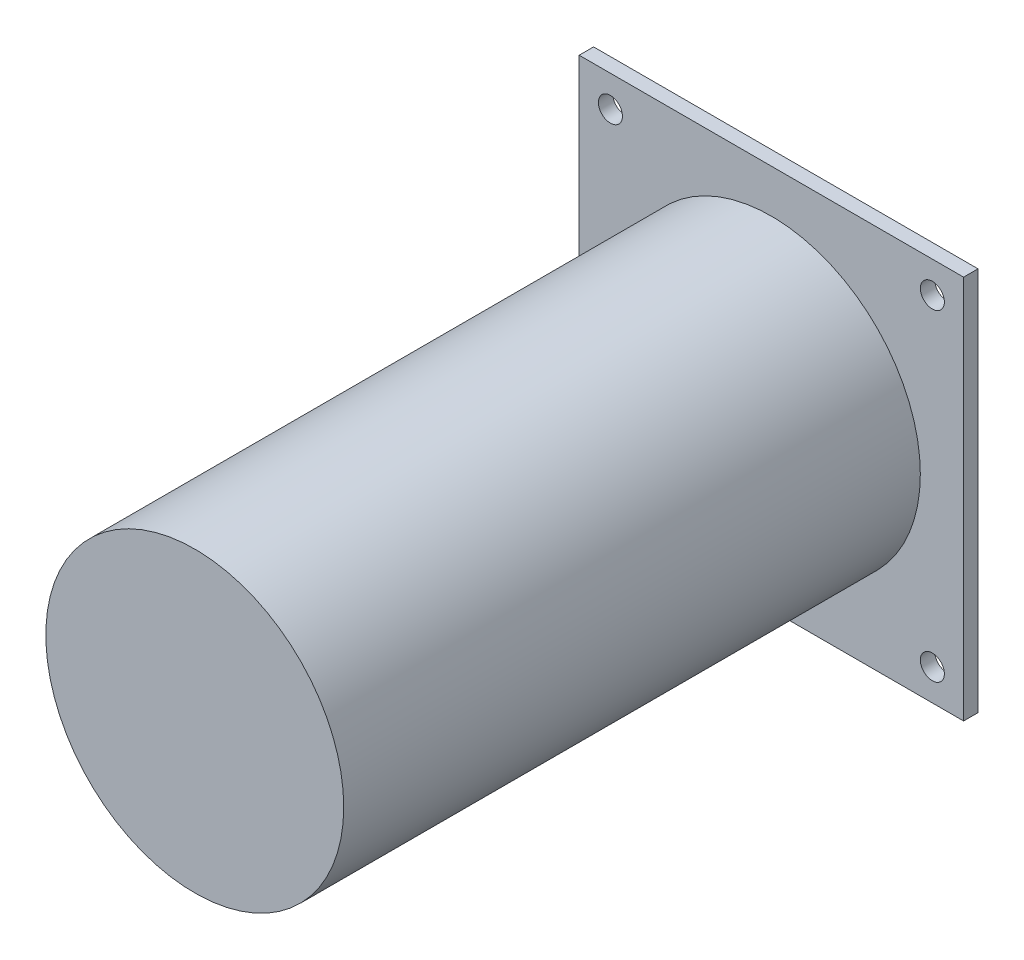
ISO-10303-21;
HEADER;
FILE_DESCRIPTION(('STEP AP214'),'2;1');
FILE_NAME('part.step','',(''),(''),'','','');
FILE_SCHEMA(('AUTOMOTIVE_DESIGN { 1 0 10303 214 1 1 1 1 }'));
ENDSEC;
DATA;
#1=APPLICATION_CONTEXT('core data for automotive mechanical design processes');
#2=APPLICATION_PROTOCOL_DEFINITION('international standard','automotive_design',2000,#1);
#3=PRODUCT_CONTEXT('',#1,'mechanical');
#4=PRODUCT('Part','Part','',(#3));
#5=PRODUCT_RELATED_PRODUCT_CATEGORY('part','',(#4));
#6=PRODUCT_DEFINITION_FORMATION('','',#4);
#7=PRODUCT_DEFINITION_CONTEXT('part definition',#1,'design');
#8=PRODUCT_DEFINITION('design','',#6,#7);
#9=PRODUCT_DEFINITION_SHAPE('','',#8);
#10=(LENGTH_UNIT() NAMED_UNIT(*) SI_UNIT(.MILLI.,.METRE.));
#11=(NAMED_UNIT(*) PLANE_ANGLE_UNIT() SI_UNIT($,.RADIAN.));
#12=(NAMED_UNIT(*) SI_UNIT($,.STERADIAN.) SOLID_ANGLE_UNIT());
#13=UNCERTAINTY_MEASURE_WITH_UNIT(LENGTH_MEASURE(1.E-05),#10,'distance_accuracy_value','');
#14=(GEOMETRIC_REPRESENTATION_CONTEXT(3) GLOBAL_UNCERTAINTY_ASSIGNED_CONTEXT((#13)) GLOBAL_UNIT_ASSIGNED_CONTEXT((#10,
#11,#12)) REPRESENTATION_CONTEXT('',''));
#15=CARTESIAN_POINT('',(0.,0.,0.));
#16=DIRECTION('',(0.,0.,1.));
#17=DIRECTION('',(1.,0.,0.));
#18=AXIS2_PLACEMENT_3D('',#15,#16,#17);
#19=CARTESIAN_POINT('',(0.,0.,-22.));
#20=DIRECTION('',(0.,0.,1.));
#21=DIRECTION('',(1.,0.,0.));
#22=AXIS2_PLACEMENT_3D('',#19,#20,#21);
#23=CYLINDRICAL_SURFACE('',#22,18.);
#24=CARTESIAN_POINT('',(0.,0.,-12.));
#25=DIRECTION('',(0.,0.,-1.));
#26=DIRECTION('',(-1.,0.,0.));
#27=AXIS2_PLACEMENT_3D('',#24,#25,#26);
#28=CIRCLE('',#27,18.);
#29=CARTESIAN_POINT('',(-18.,0.,-12.));
#30=VERTEX_POINT('',#29);
#31=EDGE_CURVE('E137',#30,#30,#28,.T.);
#32=ORIENTED_EDGE('',*,*,#31,.T.);
#33=EDGE_LOOP('',(#32));
#34=FACE_BOUND('',#33,.T.);
#35=CARTESIAN_POINT('',(0.,0.,-14.5));
#36=DIRECTION('',(0.,0.,-1.));
#37=DIRECTION('',(-1.,0.,0.));
#38=AXIS2_PLACEMENT_3D('',#35,#36,#37);
#39=CIRCLE('',#38,18.);
#40=CARTESIAN_POINT('',(-18.,0.,-14.5));
#41=VERTEX_POINT('',#40);
#42=EDGE_CURVE('E130',#41,#41,#39,.T.);
#43=ORIENTED_EDGE('',*,*,#42,.F.);
#44=EDGE_LOOP('',(#43));
#45=FACE_BOUND('',#44,.T.);
#46=ADVANCED_FACE('F41',(#34,#45),#23,.T.);
#47=CARTESIAN_POINT('',(0.,0.,120.));
#48=DIRECTION('',(0.,0.,-1.));
#49=DIRECTION('',(-1.,0.,0.));
#50=AXIS2_PLACEMENT_3D('',#47,#48,#49);
#51=CYLINDRICAL_SURFACE('',#50,31.);
#52=CARTESIAN_POINT('',(0.,0.,120.));
#53=DIRECTION('',(0.,0.,1.));
#54=DIRECTION('',(1.,0.,0.));
#55=AXIS2_PLACEMENT_3D('',#52,#53,#54);
#56=CIRCLE('',#55,31.);
#57=CARTESIAN_POINT('',(31.,0.,120.));
#58=VERTEX_POINT('',#57);
#59=EDGE_CURVE('E121',#58,#58,#56,.T.);
#60=ORIENTED_EDGE('',*,*,#59,.F.);
#61=EDGE_LOOP('',(#60));
#62=FACE_BOUND('',#61,.T.);
#63=CARTESIAN_POINT('',(0.,0.,0.));
#64=DIRECTION('',(0.,0.,1.));
#65=DIRECTION('',(1.,0.,0.));
#66=AXIS2_PLACEMENT_3D('',#63,#64,#65);
#67=CIRCLE('',#66,31.);
#68=CARTESIAN_POINT('',(31.,0.,0.));
#69=VERTEX_POINT('',#68);
#70=EDGE_CURVE('E120',#69,#69,#67,.T.);
#71=ORIENTED_EDGE('',*,*,#70,.T.);
#72=EDGE_LOOP('',(#71));
#73=FACE_BOUND('',#72,.T.);
#74=ADVANCED_FACE('F174',(#62,#73),#51,.T.);
#75=CARTESIAN_POINT('',(0.,0.,120.));
#76=DIRECTION('',(0.,0.,1.));
#77=DIRECTION('',(1.,0.,0.));
#78=AXIS2_PLACEMENT_3D('',#75,#76,#77);
#79=PLANE('',#78);
#80=ORIENTED_EDGE('',*,*,#59,.T.);
#81=EDGE_LOOP('',(#80));
#82=FACE_BOUND('',#81,.T.);
#83=ADVANCED_FACE('F180',(#82),#79,.T.);
#84=CARTESIAN_POINT('',(-40.,-40.,-3.));
#85=DIRECTION('',(1.,0.,0.));
#86=DIRECTION('',(0.,0.,-1.));
#87=AXIS2_PLACEMENT_3D('',#84,#85,#86);
#88=PLANE('',#87);
#89=DIRECTION('',(0.,1.,0.));
#90=VECTOR('',#89,1.);
#91=CARTESIAN_POINT('',(-40.,-40.,0.));
#92=LINE('',#91,#90);
#93=CARTESIAN_POINT('',(-40.,-40.,0.));
#94=VERTEX_POINT('',#93);
#95=CARTESIAN_POINT('',(-40.,40.,0.));
#96=VERTEX_POINT('',#95);
#97=EDGE_CURVE('E110',#94,#96,#92,.T.);
#98=ORIENTED_EDGE('',*,*,#97,.T.);
#99=DIRECTION('',(0.,0.,1.));
#100=VECTOR('',#99,1.);
#101=CARTESIAN_POINT('',(-40.,40.,-3.));
#102=LINE('',#101,#100);
#103=CARTESIAN_POINT('',(-40.,40.,-3.));
#104=VERTEX_POINT('',#103);
#105=EDGE_CURVE('E101',#104,#96,#102,.T.);
#106=ORIENTED_EDGE('',*,*,#105,.F.);
#107=DIRECTION('',(0.,1.,0.));
#108=VECTOR('',#107,1.);
#109=CARTESIAN_POINT('',(-40.,-40.,-3.));
#110=LINE('',#109,#108);
#111=CARTESIAN_POINT('',(-40.,-40.,-3.));
#112=VERTEX_POINT('',#111);
#113=EDGE_CURVE('E95',#112,#104,#110,.T.);
#114=ORIENTED_EDGE('',*,*,#113,.F.);
#115=DIRECTION('',(0.,0.,1.));
#116=VECTOR('',#115,1.);
#117=CARTESIAN_POINT('',(-40.,-40.,-3.));
#118=LINE('',#117,#116);
#119=EDGE_CURVE('E106',#112,#94,#118,.T.);
#120=ORIENTED_EDGE('',*,*,#119,.T.);
#121=EDGE_LOOP('',(#98,#106,#114,#120));
#122=FACE_BOUND('',#121,.T.);
#123=ADVANCED_FACE('F258',(#122),#88,.F.);
#124=CARTESIAN_POINT('',(40.,40.,-3.));
#125=DIRECTION('',(0.,-1.,0.));
#126=DIRECTION('',(0.,0.,-1.));
#127=AXIS2_PLACEMENT_3D('',#124,#125,#126);
#128=PLANE('',#127);
#129=DIRECTION('',(1.,0.,0.));
#130=VECTOR('',#129,1.);
#131=CARTESIAN_POINT('',(40.,40.,0.));
#132=LINE('',#131,#130);
#133=CARTESIAN_POINT('',(40.,40.,0.));
#134=VERTEX_POINT('',#133);
#135=EDGE_CURVE('E100',#96,#134,#132,.T.);
#136=ORIENTED_EDGE('',*,*,#135,.T.);
#137=DIRECTION('',(0.,0.,1.));
#138=VECTOR('',#137,1.);
#139=CARTESIAN_POINT('',(40.,40.,-3.));
#140=LINE('',#139,#138);
#141=CARTESIAN_POINT('',(40.,40.,-3.));
#142=VERTEX_POINT('',#141);
#143=EDGE_CURVE('E98',#142,#134,#140,.T.);
#144=ORIENTED_EDGE('',*,*,#143,.F.);
#145=DIRECTION('',(1.,0.,0.));
#146=VECTOR('',#145,1.);
#147=CARTESIAN_POINT('',(40.,40.,-3.));
#148=LINE('',#147,#146);
#149=EDGE_CURVE('E90',#104,#142,#148,.T.);
#150=ORIENTED_EDGE('',*,*,#149,.F.);
#151=ORIENTED_EDGE('',*,*,#105,.T.);
#152=EDGE_LOOP('',(#136,#144,#150,#151));
#153=FACE_BOUND('',#152,.T.);
#154=ADVANCED_FACE('F99',(#153),#128,.F.);
#155=CARTESIAN_POINT('',(40.,-40.,-3.));
#156=DIRECTION('',(-1.,0.,0.));
#157=DIRECTION('',(0.,0.,1.));
#158=AXIS2_PLACEMENT_3D('',#155,#156,#157);
#159=PLANE('',#158);
#160=DIRECTION('',(0.,-1.,0.));
#161=VECTOR('',#160,1.);
#162=CARTESIAN_POINT('',(40.,-40.,0.));
#163=LINE('',#162,#161);
#164=CARTESIAN_POINT('',(40.,-40.,0.));
#165=VERTEX_POINT('',#164);
#166=EDGE_CURVE('E76',#134,#165,#163,.T.);
#167=ORIENTED_EDGE('',*,*,#166,.T.);
#168=DIRECTION('',(0.,0.,1.));
#169=VECTOR('',#168,1.);
#170=CARTESIAN_POINT('',(40.,-40.,-3.));
#171=LINE('',#170,#169);
#172=CARTESIAN_POINT('',(40.,-40.,-3.));
#173=VERTEX_POINT('',#172);
#174=EDGE_CURVE('E102',#173,#165,#171,.T.);
#175=ORIENTED_EDGE('',*,*,#174,.F.);
#176=DIRECTION('',(0.,-1.,0.));
#177=VECTOR('',#176,1.);
#178=CARTESIAN_POINT('',(40.,-40.,-3.));
#179=LINE('',#178,#177);
#180=EDGE_CURVE('E93',#142,#173,#179,.T.);
#181=ORIENTED_EDGE('',*,*,#180,.F.);
#182=ORIENTED_EDGE('',*,*,#143,.T.);
#183=EDGE_LOOP('',(#167,#175,#181,#182));
#184=FACE_BOUND('',#183,.T.);
#185=ADVANCED_FACE('F104',(#184),#159,.F.);
#186=CARTESIAN_POINT('',(40.,-40.,-3.));
#187=DIRECTION('',(0.,1.,0.));
#188=DIRECTION('',(0.,0.,1.));
#189=AXIS2_PLACEMENT_3D('',#186,#187,#188);
#190=PLANE('',#189);
#191=DIRECTION('',(-1.,0.,0.));
#192=VECTOR('',#191,1.);
#193=CARTESIAN_POINT('',(40.,-40.,0.));
#194=LINE('',#193,#192);
#195=EDGE_CURVE('E82',#165,#94,#194,.T.);
#196=ORIENTED_EDGE('',*,*,#195,.T.);
#197=ORIENTED_EDGE('',*,*,#119,.F.);
#198=DIRECTION('',(-1.,0.,0.));
#199=VECTOR('',#198,1.);
#200=CARTESIAN_POINT('',(40.,-40.,-3.));
#201=LINE('',#200,#199);
#202=EDGE_CURVE('E59',#173,#112,#201,.T.);
#203=ORIENTED_EDGE('',*,*,#202,.F.);
#204=ORIENTED_EDGE('',*,*,#174,.T.);
#205=EDGE_LOOP('',(#196,#197,#203,#204));
#206=FACE_BOUND('',#205,.T.);
#207=ADVANCED_FACE('F229',(#206),#190,.F.);
#208=CARTESIAN_POINT('',(0.,0.,-3.));
#209=DIRECTION('',(0.,0.,1.));
#210=DIRECTION('',(1.,0.,0.));
#211=AXIS2_PLACEMENT_3D('',#208,#209,#210);
#212=PLANE('',#211);
#213=CARTESIAN_POINT('',(33.5,33.5,-3.));
#214=DIRECTION('',(0.,0.,-1.));
#215=DIRECTION('',(-1.,0.,0.));
#216=AXIS2_PLACEMENT_3D('',#213,#214,#215);
#217=CIRCLE('',#216,2.49999999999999);
#218=CARTESIAN_POINT('',(31.,33.5,-3.));
#219=VERTEX_POINT('',#218);
#220=EDGE_CURVE('E220',#219,#219,#217,.T.);
#221=ORIENTED_EDGE('',*,*,#220,.F.);
#222=EDGE_LOOP('',(#221));
#223=FACE_BOUND('',#222,.T.);
#224=CARTESIAN_POINT('',(33.5,-33.5,-3.));
#225=DIRECTION('',(0.,0.,-1.));
#226=DIRECTION('',(-1.,0.,0.));
#227=AXIS2_PLACEMENT_3D('',#224,#225,#226);
#228=CIRCLE('',#227,2.49999999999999);
#229=CARTESIAN_POINT('',(31.,-33.5,-3.));
#230=VERTEX_POINT('',#229);
#231=EDGE_CURVE('E214',#230,#230,#228,.T.);
#232=ORIENTED_EDGE('',*,*,#231,.F.);
#233=EDGE_LOOP('',(#232));
#234=FACE_BOUND('',#233,.T.);
#235=CARTESIAN_POINT('',(-33.5,-33.5,-3.));
#236=DIRECTION('',(0.,0.,-1.));
#237=DIRECTION('',(-1.,0.,0.));
#238=AXIS2_PLACEMENT_3D('',#235,#236,#237);
#239=CIRCLE('',#238,2.49999999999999);
#240=CARTESIAN_POINT('',(-36.,-33.5,-3.));
#241=VERTEX_POINT('',#240);
#242=EDGE_CURVE('E211',#241,#241,#239,.T.);
#243=ORIENTED_EDGE('',*,*,#242,.F.);
#244=EDGE_LOOP('',(#243));
#245=FACE_BOUND('',#244,.T.);
#246=CARTESIAN_POINT('',(-33.5,33.5,-3.));
#247=DIRECTION('',(0.,0.,-1.));
#248=DIRECTION('',(-1.,0.,0.));
#249=AXIS2_PLACEMENT_3D('',#246,#247,#248);
#250=CIRCLE('',#249,2.49999999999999);
#251=CARTESIAN_POINT('',(-36.,33.5,-3.));
#252=VERTEX_POINT('',#251);
#253=EDGE_CURVE('E205',#252,#252,#250,.T.);
#254=ORIENTED_EDGE('',*,*,#253,.F.);
#255=EDGE_LOOP('',(#254));
#256=FACE_BOUND('',#255,.T.);
#257=CARTESIAN_POINT('',(0.,0.,-3.));
#258=DIRECTION('',(0.,0.,1.));
#259=DIRECTION('',(1.,0.,0.));
#260=AXIS2_PLACEMENT_3D('',#257,#258,#259);
#261=CIRCLE('',#260,6.);
#262=CARTESIAN_POINT('',(6.,0.,-3.));
#263=VERTEX_POINT('',#262);
#264=EDGE_CURVE('E124',#263,#263,#261,.F.);
#265=ORIENTED_EDGE('',*,*,#264,.F.);
#266=EDGE_LOOP('',(#265));
#267=FACE_BOUND('',#266,.T.);
#268=ORIENTED_EDGE('',*,*,#113,.T.);
#269=ORIENTED_EDGE('',*,*,#149,.T.);
#270=ORIENTED_EDGE('',*,*,#180,.T.);
#271=ORIENTED_EDGE('',*,*,#202,.T.);
#272=EDGE_LOOP('',(#268,#269,#270,#271));
#273=FACE_BOUND('',#272,.T.);
#274=ADVANCED_FACE('F91',(#223,#234,#245,#256,#267,#273),#212,.F.);
#275=CARTESIAN_POINT('',(0.,0.,0.));
#276=DIRECTION('',(0.,0.,1.));
#277=DIRECTION('',(1.,0.,0.));
#278=AXIS2_PLACEMENT_3D('',#275,#276,#277);
#279=PLANE('',#278);
#280=CARTESIAN_POINT('',(33.5,33.5,0.));
#281=DIRECTION('',(0.,0.,1.));
#282=DIRECTION('',(1.,0.,0.));
#283=AXIS2_PLACEMENT_3D('',#280,#281,#282);
#284=CIRCLE('',#283,2.49999999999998);
#285=CARTESIAN_POINT('',(36.,33.5,0.));
#286=VERTEX_POINT('',#285);
#287=EDGE_CURVE('E217',#286,#286,#284,.T.);
#288=ORIENTED_EDGE('',*,*,#287,.F.);
#289=EDGE_LOOP('',(#288));
#290=FACE_BOUND('',#289,.T.);
#291=CARTESIAN_POINT('',(33.5,-33.5,0.));
#292=DIRECTION('',(0.,0.,1.));
#293=DIRECTION('',(1.,0.,0.));
#294=AXIS2_PLACEMENT_3D('',#291,#292,#293);
#295=CIRCLE('',#294,2.49999999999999);
#296=CARTESIAN_POINT('',(36.,-33.5,0.));
#297=VERTEX_POINT('',#296);
#298=EDGE_CURVE('E45',#297,#297,#295,.T.);
#299=ORIENTED_EDGE('',*,*,#298,.F.);
#300=EDGE_LOOP('',(#299));
#301=FACE_BOUND('',#300,.T.);
#302=CARTESIAN_POINT('',(-33.5,-33.5,0.));
#303=DIRECTION('',(0.,0.,1.));
#304=DIRECTION('',(1.,0.,0.));
#305=AXIS2_PLACEMENT_3D('',#302,#303,#304);
#306=CIRCLE('',#305,2.49999999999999);
#307=CARTESIAN_POINT('',(-31.,-33.5,0.));
#308=VERTEX_POINT('',#307);
#309=EDGE_CURVE('E208',#308,#308,#306,.T.);
#310=ORIENTED_EDGE('',*,*,#309,.F.);
#311=EDGE_LOOP('',(#310));
#312=FACE_BOUND('',#311,.T.);
#313=CARTESIAN_POINT('',(-33.5,33.5,0.));
#314=DIRECTION('',(0.,0.,1.));
#315=DIRECTION('',(1.,0.,0.));
#316=AXIS2_PLACEMENT_3D('',#313,#314,#315);
#317=CIRCLE('',#316,2.49999999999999);
#318=CARTESIAN_POINT('',(-31.,33.5,0.));
#319=VERTEX_POINT('',#318);
#320=EDGE_CURVE('E134',#319,#319,#317,.T.);
#321=ORIENTED_EDGE('',*,*,#320,.F.);
#322=EDGE_LOOP('',(#321));
#323=FACE_BOUND('',#322,.T.);
#324=ORIENTED_EDGE('',*,*,#70,.F.);
#325=EDGE_LOOP('',(#324));
#326=FACE_BOUND('',#325,.T.);
#327=ORIENTED_EDGE('',*,*,#97,.F.);
#328=ORIENTED_EDGE('',*,*,#195,.F.);
#329=ORIENTED_EDGE('',*,*,#166,.F.);
#330=ORIENTED_EDGE('',*,*,#135,.F.);
#331=EDGE_LOOP('',(#327,#328,#329,#330));
#332=FACE_BOUND('',#331,.T.);
#333=ADVANCED_FACE('F228',(#290,#301,#312,#323,#326,#332),#279,.T.);
#334=CARTESIAN_POINT('',(0.,0.,-12.));
#335=DIRECTION('',(0.,0.,1.));
#336=DIRECTION('',(1.,0.,0.));
#337=AXIS2_PLACEMENT_3D('',#334,#335,#336);
#338=CYLINDRICAL_SURFACE('',#337,6.);
#339=CARTESIAN_POINT('',(0.,0.,-12.));
#340=DIRECTION('',(0.,0.,-1.));
#341=DIRECTION('',(-1.,0.,0.));
#342=AXIS2_PLACEMENT_3D('',#339,#340,#341);
#343=CIRCLE('',#342,6.);
#344=CARTESIAN_POINT('',(-6.,0.,-12.));
#345=VERTEX_POINT('',#344);
#346=EDGE_CURVE('E113',#345,#345,#343,.T.);
#347=ORIENTED_EDGE('',*,*,#346,.F.);
#348=EDGE_LOOP('',(#347));
#349=FACE_BOUND('',#348,.T.);
#350=ORIENTED_EDGE('',*,*,#264,.T.);
#351=EDGE_LOOP('',(#350));
#352=FACE_BOUND('',#351,.T.);
#353=ADVANCED_FACE('F239',(#349,#352),#338,.T.);
#354=CARTESIAN_POINT('',(0.,0.,-12.));
#355=DIRECTION('',(0.,0.,-1.));
#356=DIRECTION('',(-1.,0.,0.));
#357=AXIS2_PLACEMENT_3D('',#354,#355,#356);
#358=PLANE('',#357);
#359=ORIENTED_EDGE('',*,*,#346,.T.);
#360=EDGE_LOOP('',(#359));
#361=FACE_BOUND('',#360,.T.);
#362=ORIENTED_EDGE('',*,*,#31,.F.);
#363=EDGE_LOOP('',(#362));
#364=FACE_BOUND('',#363,.T.);
#365=ADVANCED_FACE('F241',(#361,#364),#358,.F.);
#366=CARTESIAN_POINT('',(0.,22.,-19.5));
#367=DIRECTION('',(0.,0.,-1.));
#368=DIRECTION('',(-1.,0.,0.));
#369=AXIS2_PLACEMENT_3D('',#366,#367,#368);
#370=PLANE('',#369);
#371=CARTESIAN_POINT('',(0.,0.,-19.5));
#372=DIRECTION('',(0.,0.,-1.));
#373=DIRECTION('',(-1.,0.,0.));
#374=AXIS2_PLACEMENT_3D('',#371,#372,#373);
#375=CIRCLE('',#374,15.5);
#376=CARTESIAN_POINT('',(-15.5,0.,-19.5));
#377=VERTEX_POINT('',#376);
#378=EDGE_CURVE('E51',#377,#377,#375,.T.);
#379=ORIENTED_EDGE('',*,*,#378,.T.);
#380=EDGE_LOOP('',(#379));
#381=FACE_BOUND('',#380,.T.);
#382=CARTESIAN_POINT('',(0.,0.,-19.5));
#383=DIRECTION('',(0.,0.,-1.));
#384=DIRECTION('',(-1.,0.,0.));
#385=AXIS2_PLACEMENT_3D('',#382,#383,#384);
#386=CIRCLE('',#385,18.);
#387=CARTESIAN_POINT('',(-18.,0.,-19.5));
#388=VERTEX_POINT('',#387);
#389=EDGE_CURVE('E133',#388,#388,#386,.T.);
#390=ORIENTED_EDGE('',*,*,#389,.F.);
#391=EDGE_LOOP('',(#390));
#392=FACE_BOUND('',#391,.T.);
#393=ADVANCED_FACE('F146',(#381,#392),#370,.F.);
#394=CARTESIAN_POINT('',(0.,22.,-14.5));
#395=DIRECTION('',(0.,0.,-1.));
#396=DIRECTION('',(-1.,0.,0.));
#397=AXIS2_PLACEMENT_3D('',#394,#395,#396);
#398=PLANE('',#397);
#399=CARTESIAN_POINT('',(0.,0.,-14.5));
#400=DIRECTION('',(0.,0.,-1.));
#401=DIRECTION('',(-1.,0.,0.));
#402=AXIS2_PLACEMENT_3D('',#399,#400,#401);
#403=CIRCLE('',#402,15.5);
#404=CARTESIAN_POINT('',(-15.5,0.,-14.5));
#405=VERTEX_POINT('',#404);
#406=EDGE_CURVE('E11',#405,#405,#403,.F.);
#407=ORIENTED_EDGE('',*,*,#406,.T.);
#408=EDGE_LOOP('',(#407));
#409=FACE_BOUND('',#408,.T.);
#410=ORIENTED_EDGE('',*,*,#42,.T.);
#411=EDGE_LOOP('',(#410));
#412=FACE_BOUND('',#411,.T.);
#413=ADVANCED_FACE('F159',(#409,#412),#398,.T.);
#414=CARTESIAN_POINT('',(0.,0.,0.));
#415=DIRECTION('',(0.,0.,1.));
#416=DIRECTION('',(1.,0.,0.));
#417=AXIS2_PLACEMENT_3D('',#414,#415,#416);
#418=CYLINDRICAL_SURFACE('',#417,14.);
#419=CARTESIAN_POINT('',(0.,0.,-18.));
#420=DIRECTION('',(0.,0.,-1.));
#421=DIRECTION('',(-1.,0.,0.));
#422=AXIS2_PLACEMENT_3D('',#419,#420,#421);
#423=CIRCLE('',#422,14.);
#424=CARTESIAN_POINT('',(-14.,0.,-18.));
#425=VERTEX_POINT('',#424);
#426=EDGE_CURVE('E140',#425,#425,#423,.F.);
#427=ORIENTED_EDGE('',*,*,#426,.T.);
#428=EDGE_LOOP('',(#427));
#429=FACE_BOUND('',#428,.T.);
#430=CARTESIAN_POINT('',(0.,0.,-16.));
#431=DIRECTION('',(0.,0.,-1.));
#432=DIRECTION('',(-1.,0.,0.));
#433=AXIS2_PLACEMENT_3D('',#430,#431,#432);
#434=CIRCLE('',#433,14.);
#435=CARTESIAN_POINT('',(-14.,0.,-16.));
#436=VERTEX_POINT('',#435);
#437=EDGE_CURVE('E129',#436,#436,#434,.T.);
#438=ORIENTED_EDGE('',*,*,#437,.T.);
#439=EDGE_LOOP('',(#438));
#440=FACE_BOUND('',#439,.T.);
#441=ADVANCED_FACE('F155',(#429,#440),#418,.T.);
#442=CARTESIAN_POINT('',(0.,0.,-22.));
#443=DIRECTION('',(0.,0.,-1.));
#444=DIRECTION('',(-1.,0.,0.));
#445=AXIS2_PLACEMENT_3D('',#442,#443,#444);
#446=PLANE('',#445);
#447=CARTESIAN_POINT('',(0.,0.,-22.));
#448=DIRECTION('',(0.,0.,-1.));
#449=DIRECTION('',(-1.,0.,0.));
#450=AXIS2_PLACEMENT_3D('',#447,#448,#449);
#451=CIRCLE('',#450,18.);
#452=CARTESIAN_POINT('',(-18.,0.,-22.));
#453=VERTEX_POINT('',#452);
#454=EDGE_CURVE('E197',#453,#453,#451,.T.);
#455=ORIENTED_EDGE('',*,*,#454,.T.);
#456=EDGE_LOOP('',(#455));
#457=FACE_BOUND('',#456,.T.);
#458=ADVANCED_FACE('F158',(#457),#446,.T.);
#459=ORIENTED_EDGE('',*,*,#389,.T.);
#460=EDGE_LOOP('',(#459));
#461=FACE_BOUND('',#460,.T.);
#462=ORIENTED_EDGE('',*,*,#454,.F.);
#463=EDGE_LOOP('',(#462));
#464=FACE_BOUND('',#463,.T.);
#465=ADVANCED_FACE('F152',(#461,#464),#23,.T.);
#466=CARTESIAN_POINT('',(0.,0.,-18.));
#467=DIRECTION('',(0.,0.,-1.));
#468=DIRECTION('',(-1.,0.,0.));
#469=AXIS2_PLACEMENT_3D('',#466,#467,#468);
#470=TOROIDAL_SURFACE('',#469,15.5,1.5);
#471=ORIENTED_EDGE('',*,*,#378,.F.);
#472=EDGE_LOOP('',(#471));
#473=FACE_BOUND('',#472,.T.);
#474=ORIENTED_EDGE('',*,*,#426,.F.);
#475=EDGE_LOOP('',(#474));
#476=FACE_BOUND('',#475,.T.);
#477=ADVANCED_FACE('F149',(#473,#476),#470,.F.);
#478=CARTESIAN_POINT('',(0.,0.,-16.));
#479=DIRECTION('',(0.,0.,-1.));
#480=DIRECTION('',(-1.,0.,0.));
#481=AXIS2_PLACEMENT_3D('',#478,#479,#480);
#482=TOROIDAL_SURFACE('',#481,15.5,1.5);
#483=ORIENTED_EDGE('',*,*,#437,.F.);
#484=EDGE_LOOP('',(#483));
#485=FACE_BOUND('',#484,.T.);
#486=ORIENTED_EDGE('',*,*,#406,.F.);
#487=EDGE_LOOP('',(#486));
#488=FACE_BOUND('',#487,.T.);
#489=ADVANCED_FACE('F43',(#485,#488),#482,.F.);
#490=CARTESIAN_POINT('',(-33.5,33.5,-3.));
#491=DIRECTION('',(0.,0.,-1.));
#492=DIRECTION('',(-1.,0.,0.));
#493=AXIS2_PLACEMENT_3D('',#490,#491,#492);
#494=CYLINDRICAL_SURFACE('',#493,2.49999999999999);
#495=ORIENTED_EDGE('',*,*,#320,.T.);
#496=EDGE_LOOP('',(#495));
#497=FACE_BOUND('',#496,.T.);
#498=ORIENTED_EDGE('',*,*,#253,.T.);
#499=EDGE_LOOP('',(#498));
#500=FACE_BOUND('',#499,.T.);
#501=ADVANCED_FACE('F165',(#497,#500),#494,.F.);
#502=CARTESIAN_POINT('',(-33.5,-33.5,-3.));
#503=DIRECTION('',(0.,0.,-1.));
#504=DIRECTION('',(-1.,0.,0.));
#505=AXIS2_PLACEMENT_3D('',#502,#503,#504);
#506=CYLINDRICAL_SURFACE('',#505,2.49999999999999);
#507=ORIENTED_EDGE('',*,*,#309,.T.);
#508=EDGE_LOOP('',(#507));
#509=FACE_BOUND('',#508,.T.);
#510=ORIENTED_EDGE('',*,*,#242,.T.);
#511=EDGE_LOOP('',(#510));
#512=FACE_BOUND('',#511,.T.);
#513=ADVANCED_FACE('F316',(#509,#512),#506,.F.);
#514=CARTESIAN_POINT('',(33.5,-33.5,-3.));
#515=DIRECTION('',(0.,0.,-1.));
#516=DIRECTION('',(-1.,0.,0.));
#517=AXIS2_PLACEMENT_3D('',#514,#515,#516);
#518=CYLINDRICAL_SURFACE('',#517,2.49999999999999);
#519=ORIENTED_EDGE('',*,*,#298,.T.);
#520=EDGE_LOOP('',(#519));
#521=FACE_BOUND('',#520,.T.);
#522=ORIENTED_EDGE('',*,*,#231,.T.);
#523=EDGE_LOOP('',(#522));
#524=FACE_BOUND('',#523,.T.);
#525=ADVANCED_FACE('F330',(#521,#524),#518,.F.);
#526=CARTESIAN_POINT('',(33.5,33.5,-3.));
#527=DIRECTION('',(0.,0.,-1.));
#528=DIRECTION('',(-1.,0.,0.));
#529=AXIS2_PLACEMENT_3D('',#526,#527,#528);
#530=CYLINDRICAL_SURFACE('',#529,2.49999999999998);
#531=ORIENTED_EDGE('',*,*,#287,.T.);
#532=EDGE_LOOP('',(#531));
#533=FACE_BOUND('',#532,.T.);
#534=ORIENTED_EDGE('',*,*,#220,.T.);
#535=EDGE_LOOP('',(#534));
#536=FACE_BOUND('',#535,.T.);
#537=ADVANCED_FACE('F224',(#533,#536),#530,.F.);
#538=CLOSED_SHELL('',(#46,#74,#83,#123,#154,#185,#207,#274,#333,#353,#365,#393,#413,#441,#458,
#465,#477,#489,#501,#513,#525,#537));
#539=MANIFOLD_SOLID_BREP('B2',#538);
#540=ADVANCED_BREP_SHAPE_REPRESENTATION('',(#18,#539),#14);
#541=SHAPE_DEFINITION_REPRESENTATION(#9,#540);
ENDSEC;
END-ISO-10303-21;
